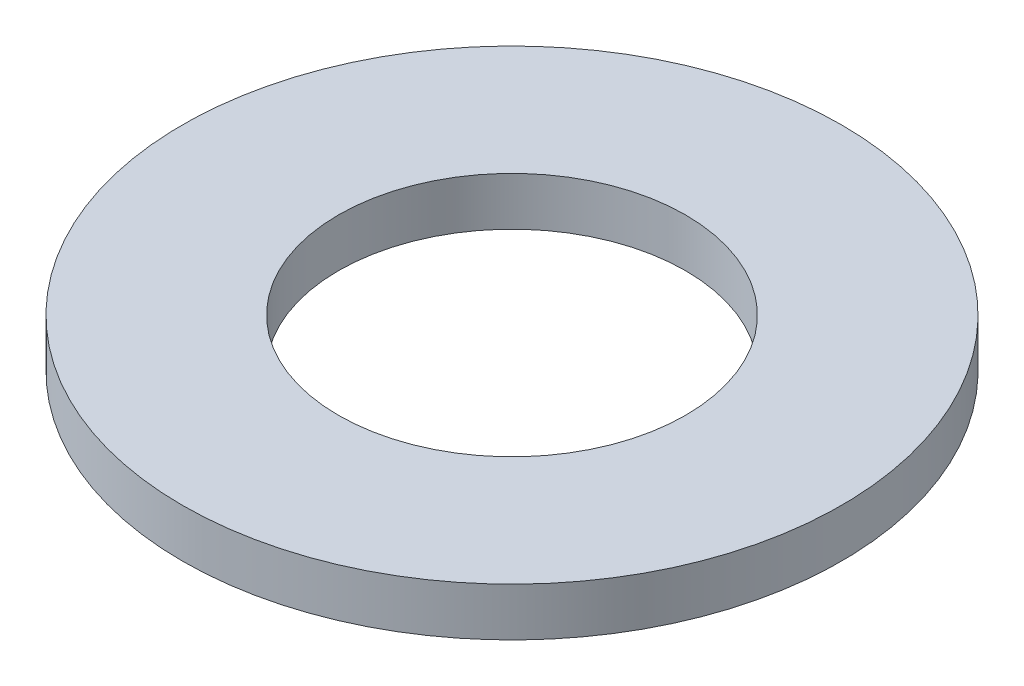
from build123d import *

# Parameters (mm, degrees)
SKETCH1_R      = 19.05
SKETCH1_R_2    = 10.033
EXTRUDE1_DEPTH = 2.794


with BuildPart() as part:
    # Sketch1 → Extrude1 (new body)
    with BuildSketch(Plane(origin=(0, 0, 0), x_dir=(1, 0, 0), z_dir=(0, 1, 0))):
        with Locations(Location((0, 0, 0), (0, 0, 270))):
            Circle(SKETCH1_R)
        with Locations(Location((0, 0, 0), (0, 0, 270))):
            Circle(SKETCH1_R_2, mode=Mode.SUBTRACT)
    extrude(amount=EXTRUDE1_DEPTH)


solid = part.part
